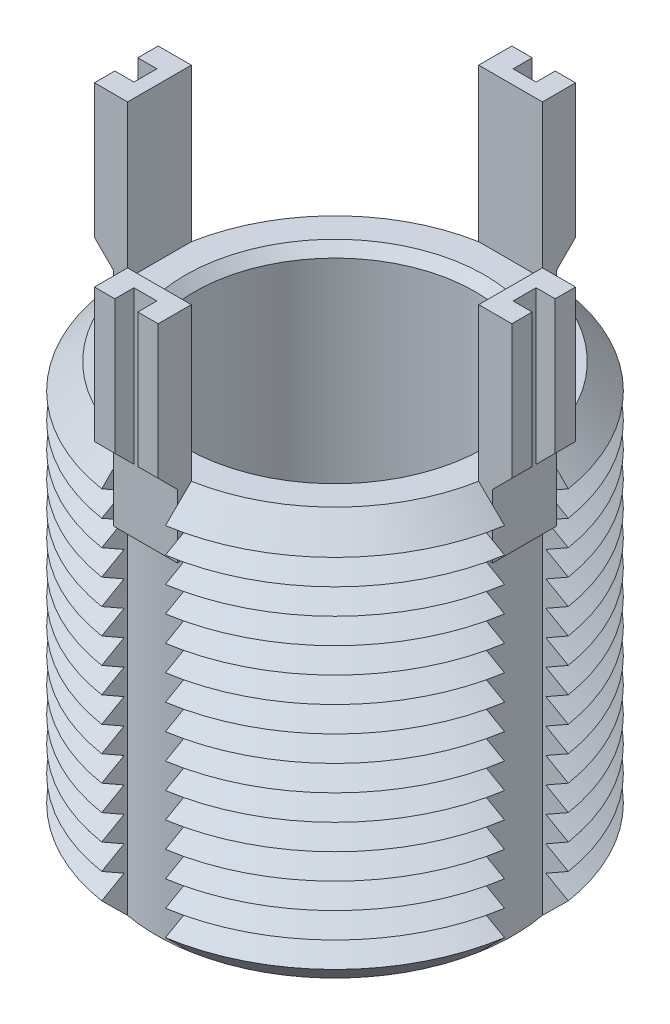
from build123d import *

# Parameters (mm, degrees)
SKETCH1_R               = 16
BOSS_EXTRUDE1_DEPTH     = 32
CHAMFER1_SIZE           = 2
LPATTERN1_COUNT         = 14
LPATTERN1_PITCH         = 2
CUT_EXTRUDE1_REACH      = 41.192
CIRPATTERN1_COUNT       = 4
BOSS_EXTRUDE3_DEPTH     = 2.5
CIRPATTERN2_COUNT       = 4
CUT_EXTRUDE3_DEPTH      = 50.722025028
CUT_EXTRUDE3_DEPTH_BACK = 50.722025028
SKETCH6_W               = 1.5
SKETCH6_H               = 1.8
SKETCH6_W_2             = 1.8
SKETCH6_H_2             = 1.5
SKETCH7_R               = 11
CUT_EXTRUDE4_DEPTH      = 32
CHAMFER2_SIZE           = 0.75


with BuildPart() as part:
    # Sketch1 → Boss-Extrude1 (new body)
    with BuildSketch(Plane(origin=(0, 0, 0), x_dir=(1, 0, 0), z_dir=(0, 1, 0))):
        with Locations(Location((0, 0, 0), (0, 0, 270))):
            Circle(SKETCH1_R)
    extrude(amount=-BOSS_EXTRUDE1_DEPTH)

    # Chamfer1
    chamfer1_edges = [part.edges().sort_by_distance(p)[0] for p in [
        (0, 0, -16),
        (0, -32, -16),
    ]]
    chamfer(chamfer1_edges, length=CHAMFER1_SIZE)

    # Sketch3 → Cut-Revolve1 (revolve, cut)
    with BuildSketch(Plane(origin=(0, 0, 0), x_dir=(0, 0, -1), z_dir=(1, 0, 0))):
        Polygon((-16, -2), (-14.267949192, -3), (-16, -4), align=None)
    cut_revolve1 = revolve(axis=Axis((0, 0.885892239, 0), (0, -1, 0)), mode=Mode.SUBTRACT)

    # LPattern1: Cut-Revolve1 ×14
    with Locations(*[(0, -i * LPATTERN1_PITCH, 0) for i in range(1, LPATTERN1_COUNT)]):
        add(cut_revolve1, mode=Mode.SUBTRACT)

    # Cut-Extrude1: up to this cone (the profile starts inside it)
    cut_extrude1_end = Plane(origin=(0, 0, 0), z_dir=(0, 1, 0)).offset(-45.999999) * Cone(1e-06, 133.692, 133.691999, align=(Align.CENTER, Align.CENTER, Align.MIN), mode=Mode.PRIVATE)
    # Sketch4 → Cut-Extrude1 (cut, up to the surface)
    with BuildSketch(Plane(origin=(0, 0, 0), x_dir=(1, 0, 0), z_dir=(0, 1, 0)), mode=Mode.PRIVATE) as cut_extrude1_sk1:
        with BuildLine():
            Line((-13.774977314, 2.5), (-15.803480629, 2.5))
            ThreePointArc((-15.803480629, 2.5), (-16, 0), (-15.803480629, -2.5))
            Line((-15.803480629, -2.5), (-13.774977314, -2.5))
            ThreePointArc((-13.774977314, -2.5), (-14, 0), (-13.774977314, 2.5))
        make_face()
    cut_extrude1_tool1 = extrude(cut_extrude1_sk1.sketch, amount=-CUT_EXTRUDE1_REACH, mode=Mode.PRIVATE) & cut_extrude1_end
    cut_extrude1 = cut_extrude1_tool1.solids().sort_by_distance((-14.929681, 0, 0))[0]
    add(cut_extrude1, mode=Mode.SUBTRACT)

    # CirPattern1: Cut-Extrude1 ×4 about axis
    cirpattern1_axis = Axis((0, 0, 0), (0, 1, 0))
    for i in range(1, CIRPATTERN1_COUNT):
        add(cut_extrude1.rotate(cirpattern1_axis, i * 360 / CIRPATTERN1_COUNT), mode=Mode.SUBTRACT)

    # Sketch5 → Boss-Extrude3 (add, symmetric)
    with BuildSketch(Plane(origin=(0, 0, 0), x_dir=(0, 0, -1), z_dir=(1, 0, 0))):
        Polygon((-13.774977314, 12), (-13.774977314, -5), (-14.874977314, -5), (-14.874977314, 0), (-16.374977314, 1.5), (-16.374977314, 12), align=None)
    boss_extrude3 = extrude(amount=BOSS_EXTRUDE3_DEPTH, both=True)

    # CirPattern2: Boss-Extrude3 ×4 about axis
    cirpattern2_axis = Axis((0, 0, 0), (0, 1, 0))
    for i in range(1, CIRPATTERN2_COUNT):
        add(boss_extrude3.rotate(cirpattern2_axis, i * 360 / CIRPATTERN2_COUNT))

    # Sketch6 → Cut-Extrude3 (cut, two sides: drawn at the far end of the back side and taken through both)
    with BuildSketch(Plane(origin=(0, 12, 0), x_dir=(1, 0, 0), z_dir=(0, 1, 0)).offset(-CUT_EXTRUDE3_DEPTH_BACK)):
        with Locations((-15.624977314, 0)):
            Rectangle(SKETCH6_W, SKETCH6_H)
        with Locations((0, 15.624977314)):
            Rectangle(SKETCH6_W_2, SKETCH6_H_2)
        with Locations((15.624977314, 0)):
            Rectangle(SKETCH6_W, SKETCH6_H)
        with Locations((0, -15.624977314)):
            Rectangle(SKETCH6_W_2, SKETCH6_H_2)
    extrude(amount=CUT_EXTRUDE3_DEPTH + CUT_EXTRUDE3_DEPTH_BACK, mode=Mode.SUBTRACT)

    # Sketch7 → Cut-Extrude4 (cut)
    with BuildSketch(Plane(origin=(0, 0, 0), x_dir=(1, 0, 0), z_dir=(0, 1, 0))):
        with Locations(Location((0, 0, 0), (0, 0, 270))):
            Circle(SKETCH7_R)
    extrude(amount=-CUT_EXTRUDE4_DEPTH, mode=Mode.SUBTRACT)

    # Chamfer2
    chamfer2_edges = [part.edges().sort_by_distance(p)[0] for p in [
        (0, 0, -11),
        (0, -32, -11),
    ]]
    chamfer(chamfer2_edges, length=CHAMFER2_SIZE)


solid = part.part
